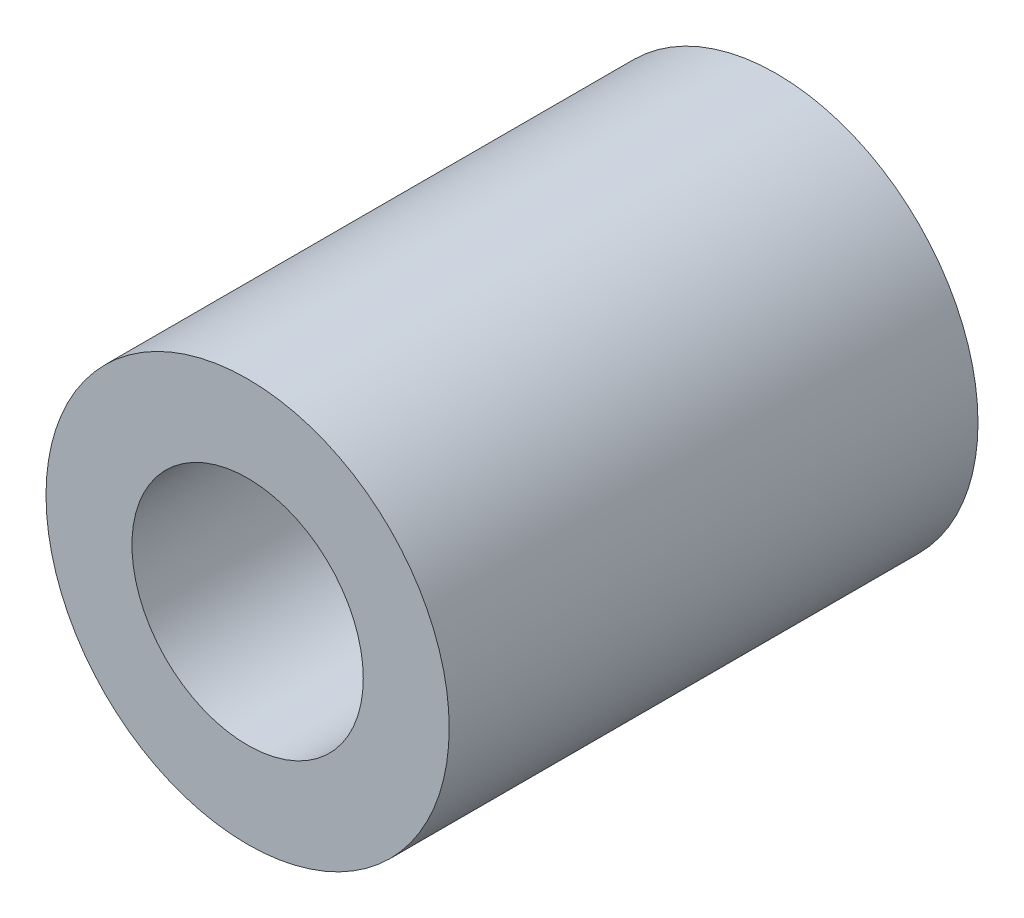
ISO-10303-21;
HEADER;
FILE_DESCRIPTION(('STEP AP214'),'2;1');
FILE_NAME('part.step','',(''),(''),'','','');
FILE_SCHEMA(('AUTOMOTIVE_DESIGN { 1 0 10303 214 1 1 1 1 }'));
ENDSEC;
DATA;
#1=APPLICATION_CONTEXT('core data for automotive mechanical design processes');
#2=APPLICATION_PROTOCOL_DEFINITION('international standard','automotive_design',2000,#1);
#3=PRODUCT_CONTEXT('',#1,'mechanical');
#4=PRODUCT('Part','Part','',(#3));
#5=PRODUCT_RELATED_PRODUCT_CATEGORY('part','',(#4));
#6=PRODUCT_DEFINITION_FORMATION('','',#4);
#7=PRODUCT_DEFINITION_CONTEXT('part definition',#1,'design');
#8=PRODUCT_DEFINITION('design','',#6,#7);
#9=PRODUCT_DEFINITION_SHAPE('','',#8);
#10=(LENGTH_UNIT() NAMED_UNIT(*) SI_UNIT(.MILLI.,.METRE.));
#11=(NAMED_UNIT(*) PLANE_ANGLE_UNIT() SI_UNIT($,.RADIAN.));
#12=(NAMED_UNIT(*) SI_UNIT($,.STERADIAN.) SOLID_ANGLE_UNIT());
#13=UNCERTAINTY_MEASURE_WITH_UNIT(LENGTH_MEASURE(1.E-05),#10,'distance_accuracy_value','');
#14=(GEOMETRIC_REPRESENTATION_CONTEXT(3) GLOBAL_UNCERTAINTY_ASSIGNED_CONTEXT((#13)) GLOBAL_UNIT_ASSIGNED_CONTEXT((#10,
#11,#12)) REPRESENTATION_CONTEXT('',''));
#15=CARTESIAN_POINT('',(0.,0.,0.));
#16=DIRECTION('',(0.,0.,1.));
#17=DIRECTION('',(1.,0.,0.));
#18=AXIS2_PLACEMENT_3D('',#15,#16,#17);
#19=CARTESIAN_POINT('',(0.,0.,8.));
#20=DIRECTION('',(0.,0.,1.));
#21=DIRECTION('',(1.,0.,0.));
#22=AXIS2_PLACEMENT_3D('',#19,#20,#21);
#23=PLANE('',#22);
#24=CARTESIAN_POINT('',(0.,0.,8.));
#25=DIRECTION('',(0.,0.,1.));
#26=DIRECTION('',(1.,0.,0.));
#27=AXIS2_PLACEMENT_3D('',#24,#25,#26);
#28=CIRCLE('',#27,3.05);
#29=CARTESIAN_POINT('',(3.05,0.,8.));
#30=VERTEX_POINT('',#29);
#31=EDGE_CURVE('E10',#30,#30,#28,.T.);
#32=ORIENTED_EDGE('',*,*,#31,.T.);
#33=EDGE_LOOP('',(#32));
#34=FACE_BOUND('',#33,.T.);
#35=CARTESIAN_POINT('',(0.,0.,8.));
#36=DIRECTION('',(0.,0.,1.));
#37=DIRECTION('',(1.,0.,0.));
#38=AXIS2_PLACEMENT_3D('',#35,#36,#37);
#39=CIRCLE('',#38,1.75);
#40=CARTESIAN_POINT('',(1.75,0.,8.));
#41=VERTEX_POINT('',#40);
#42=EDGE_CURVE('E42',#41,#41,#39,.T.);
#43=ORIENTED_EDGE('',*,*,#42,.F.);
#44=EDGE_LOOP('',(#43));
#45=FACE_BOUND('',#44,.T.);
#46=ADVANCED_FACE('F31',(#34,#45),#23,.T.);
#47=CARTESIAN_POINT('',(0.,0.,0.));
#48=DIRECTION('',(0.,0.,1.));
#49=DIRECTION('',(1.,0.,0.));
#50=AXIS2_PLACEMENT_3D('',#47,#48,#49);
#51=PLANE('',#50);
#52=CARTESIAN_POINT('',(0.,0.,0.));
#53=DIRECTION('',(0.,0.,1.));
#54=DIRECTION('',(1.,0.,0.));
#55=AXIS2_PLACEMENT_3D('',#52,#53,#54);
#56=CIRCLE('',#55,3.05);
#57=CARTESIAN_POINT('',(3.05,0.,0.));
#58=VERTEX_POINT('',#57);
#59=EDGE_CURVE('E35',#58,#58,#56,.T.);
#60=ORIENTED_EDGE('',*,*,#59,.F.);
#61=EDGE_LOOP('',(#60));
#62=FACE_BOUND('',#61,.T.);
#63=CARTESIAN_POINT('',(0.,0.,0.));
#64=DIRECTION('',(0.,0.,1.));
#65=DIRECTION('',(1.,0.,0.));
#66=AXIS2_PLACEMENT_3D('',#63,#64,#65);
#67=CIRCLE('',#66,1.75);
#68=CARTESIAN_POINT('',(1.75,0.,0.));
#69=VERTEX_POINT('',#68);
#70=EDGE_CURVE('E44',#69,#69,#67,.T.);
#71=ORIENTED_EDGE('',*,*,#70,.T.);
#72=EDGE_LOOP('',(#71));
#73=FACE_BOUND('',#72,.T.);
#74=ADVANCED_FACE('F54',(#62,#73),#51,.F.);
#75=CARTESIAN_POINT('',(0.,0.,8.));
#76=DIRECTION('',(0.,0.,-1.));
#77=DIRECTION('',(-1.,0.,0.));
#78=AXIS2_PLACEMENT_3D('',#75,#76,#77);
#79=CYLINDRICAL_SURFACE('',#78,3.05);
#80=ORIENTED_EDGE('',*,*,#31,.F.);
#81=EDGE_LOOP('',(#80));
#82=FACE_BOUND('',#81,.T.);
#83=ORIENTED_EDGE('',*,*,#59,.T.);
#84=EDGE_LOOP('',(#83));
#85=FACE_BOUND('',#84,.T.);
#86=ADVANCED_FACE('F33',(#82,#85),#79,.T.);
#87=CARTESIAN_POINT('',(0.,0.,8.));
#88=DIRECTION('',(0.,0.,-1.));
#89=DIRECTION('',(-1.,0.,0.));
#90=AXIS2_PLACEMENT_3D('',#87,#88,#89);
#91=CYLINDRICAL_SURFACE('',#90,1.75);
#92=ORIENTED_EDGE('',*,*,#42,.T.);
#93=EDGE_LOOP('',(#92));
#94=FACE_BOUND('',#93,.T.);
#95=ORIENTED_EDGE('',*,*,#70,.F.);
#96=EDGE_LOOP('',(#95));
#97=FACE_BOUND('',#96,.T.);
#98=ADVANCED_FACE('F50',(#94,#97),#91,.F.);
#99=CLOSED_SHELL('',(#46,#74,#86,#98));
#100=MANIFOLD_SOLID_BREP('B2',#99);
#101=ADVANCED_BREP_SHAPE_REPRESENTATION('',(#18,#100),#14);
#102=SHAPE_DEFINITION_REPRESENTATION(#9,#101);
ENDSEC;
END-ISO-10303-21;
